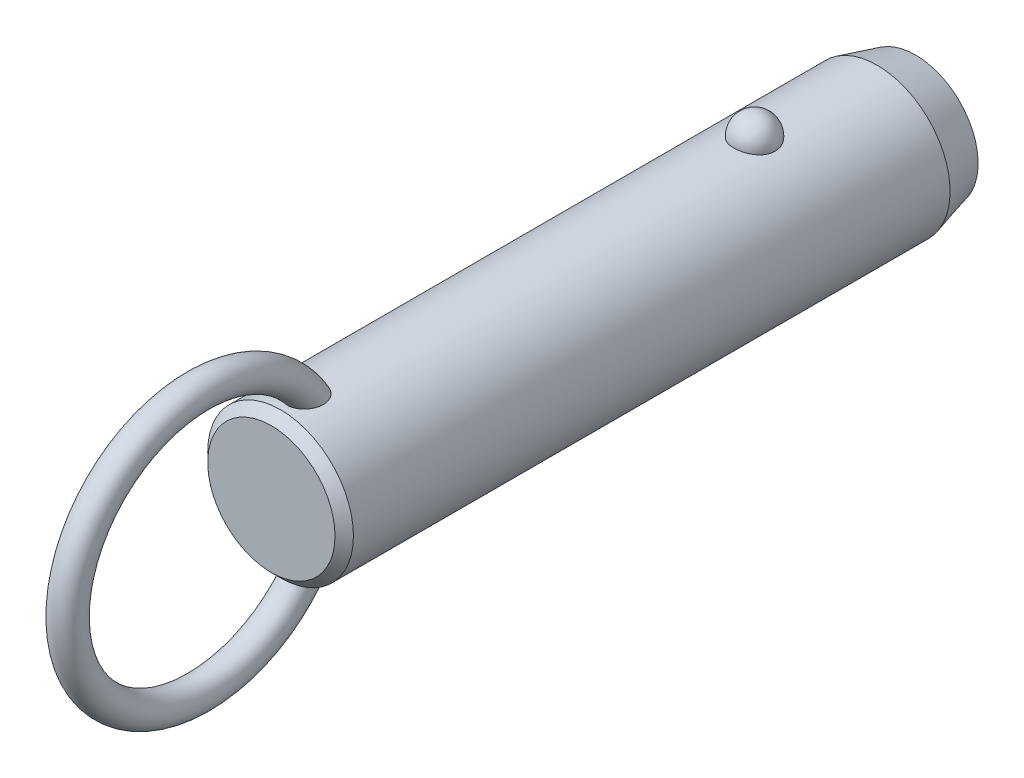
ISO-10303-21;
HEADER;
FILE_DESCRIPTION(('STEP AP214'),'2;1');
FILE_NAME('part.step','',(''),(''),'','','');
FILE_SCHEMA(('AUTOMOTIVE_DESIGN { 1 0 10303 214 1 1 1 1 }'));
ENDSEC;
DATA;
#1=APPLICATION_CONTEXT('core data for automotive mechanical design processes');
#2=APPLICATION_PROTOCOL_DEFINITION('international standard','automotive_design',2000,#1);
#3=PRODUCT_CONTEXT('',#1,'mechanical');
#4=PRODUCT('Part','Part','',(#3));
#5=PRODUCT_RELATED_PRODUCT_CATEGORY('part','',(#4));
#6=PRODUCT_DEFINITION_FORMATION('','',#4);
#7=PRODUCT_DEFINITION_CONTEXT('part definition',#1,'design');
#8=PRODUCT_DEFINITION('design','',#6,#7);
#9=PRODUCT_DEFINITION_SHAPE('','',#8);
#10=(LENGTH_UNIT() NAMED_UNIT(*) SI_UNIT(.MILLI.,.METRE.));
#11=(NAMED_UNIT(*) PLANE_ANGLE_UNIT() SI_UNIT($,.RADIAN.));
#12=(NAMED_UNIT(*) SI_UNIT($,.STERADIAN.) SOLID_ANGLE_UNIT());
#13=UNCERTAINTY_MEASURE_WITH_UNIT(LENGTH_MEASURE(1.E-05),#10,'distance_accuracy_value','');
#14=(GEOMETRIC_REPRESENTATION_CONTEXT(3) GLOBAL_UNCERTAINTY_ASSIGNED_CONTEXT((#13)) GLOBAL_UNIT_ASSIGNED_CONTEXT((#10,
#11,#12)) REPRESENTATION_CONTEXT('',''));
#15=CARTESIAN_POINT('',(0.,0.,0.));
#16=DIRECTION('',(0.,0.,1.));
#17=DIRECTION('',(1.,0.,0.));
#18=AXIS2_PLACEMENT_3D('',#15,#16,#17);
#19=CARTESIAN_POINT('',(0.,0.,50.8));
#20=DIRECTION('',(0.,0.,-1.));
#21=DIRECTION('',(-1.,0.,0.));
#22=AXIS2_PLACEMENT_3D('',#19,#20,#21);
#23=CYLINDRICAL_SURFACE('',#22,9.5);
#24=CARTESIAN_POINT('',(2.67259918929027,9.11631578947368,-2.7));
#25=CARTESIAN_POINT('',(2.6725968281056,9.11631786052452,-2.54909854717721));
#26=CARTESIAN_POINT('',(2.66030567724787,9.11994722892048,-2.39816735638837));
#27=CARTESIAN_POINT('',(2.6114347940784,9.13405924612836,-2.10058568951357));
#28=CARTESIAN_POINT('',(2.57484658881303,9.14454428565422,-1.95393672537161));
#29=CARTESIAN_POINT('',(2.47830875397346,9.17117631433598,-1.66916069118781));
#30=CARTESIAN_POINT('',(2.41836936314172,9.18732082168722,-1.53102991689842));
#31=CARTESIAN_POINT('',(2.27661331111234,9.22346780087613,-1.26705393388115));
#32=CARTESIAN_POINT('',(2.19479699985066,9.24347021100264,-1.14120852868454));
#33=CARTESIAN_POINT('',(2.01085282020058,9.28522401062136,-0.904632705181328));
#34=CARTESIAN_POINT('',(1.90862396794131,9.30698376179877,-0.793982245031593));
#35=CARTESIAN_POINT('',(1.6867437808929,9.34973971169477,-0.591607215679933));
#36=CARTESIAN_POINT('',(1.56709244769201,9.37073591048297,-0.49988264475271));
#37=CARTESIAN_POINT('',(1.31393976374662,9.40956370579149,-0.338167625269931));
#38=CARTESIAN_POINT('',(1.18048026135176,9.42740444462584,-0.268113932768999));
#39=CARTESIAN_POINT('',(0.903154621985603,9.45799906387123,-0.151390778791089));
#40=CARTESIAN_POINT('',(0.759289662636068,9.47075351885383,-0.104718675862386));
#41=CARTESIAN_POINT('',(0.468074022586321,9.48956256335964,-0.0367633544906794));
#42=CARTESIAN_POINT('',(0.320836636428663,9.49573643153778,-0.0150275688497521));
#43=CARTESIAN_POINT('',(0.0246714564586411,9.50112183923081,0.00396199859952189));
#44=CARTESIAN_POINT('',(-0.124256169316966,9.50033406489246,0.00121819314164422));
#45=CARTESIAN_POINT('',(-0.417264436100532,9.4919475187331,-0.02844418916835));
#46=CARTESIAN_POINT('',(-0.56138413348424,9.48444885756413,-0.0550074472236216));
#47=CARTESIAN_POINT('',(-0.842986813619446,9.46357853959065,-0.13106494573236));
#48=CARTESIAN_POINT('',(-0.980469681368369,9.450206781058,-0.180559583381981));
#49=CARTESIAN_POINT('',(-1.24585005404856,9.41890822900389,-0.301476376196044));
#50=CARTESIAN_POINT('',(-1.37368611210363,9.40095498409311,-0.373026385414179));
#51=CARTESIAN_POINT('',(-1.61552738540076,9.36242964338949,-0.536025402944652));
#52=CARTESIAN_POINT('',(-1.72953116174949,9.34185727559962,-0.627476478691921));
#53=CARTESIAN_POINT('',(-1.9429225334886,9.29984568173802,-0.829844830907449));
#54=CARTESIAN_POINT('',(-2.04198021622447,9.27839736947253,-0.941108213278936));
#55=CARTESIAN_POINT('',(-2.22026460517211,9.23735994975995,-1.17883414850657));
#56=CARTESIAN_POINT('',(-2.29948985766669,9.21777097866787,-1.30529781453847));
#57=CARTESIAN_POINT('',(-2.43697287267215,9.18238994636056,-1.57158566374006));
#58=CARTESIAN_POINT('',(-2.49497068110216,9.16664569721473,-1.71155057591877));
#59=CARTESIAN_POINT('',(-2.5872073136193,9.14104303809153,-1.99961197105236));
#60=CARTESIAN_POINT('',(-2.62144683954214,9.13118445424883,-2.14770821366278));
#61=CARTESIAN_POINT('',(-2.66521466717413,9.11850622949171,-2.44715424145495));
#62=CARTESIAN_POINT('',(-2.67484831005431,9.11565658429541,-2.59848735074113));
#63=CARTESIAN_POINT('',(-2.66946735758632,9.11723375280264,-2.90067317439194));
#64=CARTESIAN_POINT('',(-2.65445345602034,9.12166036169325,-3.05152590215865));
#65=CARTESIAN_POINT('',(-2.60029711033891,9.13724422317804,-3.34766110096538));
#66=CARTESIAN_POINT('',(-2.56127978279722,9.14836656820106,-3.49296833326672));
#67=CARTESIAN_POINT('',(-2.46018844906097,9.17606676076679,-3.77477535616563));
#68=CARTESIAN_POINT('',(-2.39811349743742,9.1926448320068,-3.9112747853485));
#69=CARTESIAN_POINT('',(-2.25202303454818,9.22952198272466,-4.17244273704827));
#70=CARTESIAN_POINT('',(-2.16788714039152,9.24984129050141,-4.29704106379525));
#71=CARTESIAN_POINT('',(-1.9799408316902,9.29188255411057,-4.53013066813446));
#72=CARTESIAN_POINT('',(-1.87612963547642,9.31360456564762,-4.63862130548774));
#73=CARTESIAN_POINT('',(-1.65105429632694,9.35612959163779,-4.8369029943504));
#74=CARTESIAN_POINT('',(-1.52972405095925,9.37692871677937,-4.92661991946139));
#75=CARTESIAN_POINT('',(-1.27318250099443,9.41518970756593,-5.08429106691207));
#76=CARTESIAN_POINT('',(-1.13797219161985,9.432651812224,-5.15224684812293));
#77=CARTESIAN_POINT('',(-0.859280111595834,9.46208255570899,-5.26371827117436));
#78=CARTESIAN_POINT('',(-0.715925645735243,9.47411833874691,-5.30753421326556));
#79=CARTESIAN_POINT('',(-0.423550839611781,9.4916822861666,-5.37076321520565));
#80=CARTESIAN_POINT('',(-0.2745312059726,9.49721125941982,-5.39017930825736));
#81=CARTESIAN_POINT('',(0.0218446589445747,9.50110860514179,-5.40390587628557));
#82=CARTESIAN_POINT('',(0.16917707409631,9.49961381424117,-5.39869609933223));
#83=CARTESIAN_POINT('',(0.460808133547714,9.48993906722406,-5.36441955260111));
#84=CARTESIAN_POINT('',(0.605106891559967,9.48175936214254,-5.33535367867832));
#85=CARTESIAN_POINT('',(0.886027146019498,9.4596376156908,-5.25435587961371));
#86=CARTESIAN_POINT('',(1.02267710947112,9.44571881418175,-5.20251612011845));
#87=CARTESIAN_POINT('',(1.28523827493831,9.41358993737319,-5.07741549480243));
#88=CARTESIAN_POINT('',(1.41114877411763,9.39537958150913,-5.00415322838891));
#89=CARTESIAN_POINT('',(1.65085227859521,9.3562644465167,-4.83684599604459));
#90=CARTESIAN_POINT('',(1.76442346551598,9.33532178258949,-4.74249218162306));
#91=CARTESIAN_POINT('',(1.97425672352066,9.29321198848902,-4.53620389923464));
#92=CARTESIAN_POINT('',(2.07051582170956,9.27204482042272,-4.42426641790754));
#93=CARTESIAN_POINT('',(2.24490086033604,9.23139221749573,-4.18363183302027));
#94=CARTESIAN_POINT('',(2.32267019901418,9.21194380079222,-4.05466990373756));
#95=CARTESIAN_POINT('',(2.45584092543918,9.1773419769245,-3.78517836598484));
#96=CARTESIAN_POINT('',(2.5112497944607,9.16218713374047,-3.64465264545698));
#97=CARTESIAN_POINT('',(2.59380876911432,9.13913522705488,-3.37104301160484));
#98=CARTESIAN_POINT('',(2.62330266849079,9.13064624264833,-3.23871053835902));
#99=CARTESIAN_POINT('',(2.66269870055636,9.11923566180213,-2.97092664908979));
#100=CARTESIAN_POINT('',(2.67260130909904,9.11631393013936,-2.8354753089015));
#101=CARTESIAN_POINT('',(2.67259918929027,9.11631578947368,-2.7));
#102=B_SPLINE_CURVE_WITH_KNOTS('',3,(#24,#25,#26,#27,#28,#29,#30,#31,#32,#33,#34,#35,#36,#37,
#38,#39,#40,#41,#42,#43,#44,#45,#46,#47,#48,#49,#50,#51,#52,#53,#54,#55,#56,#57,#58,#59,#60,#61,
#62,#63,#64,#65,#66,#67,#68,#69,#70,#71,#72,#73,#74,#75,#76,#77,#78,#79,#80,#81,#82,#83,#84,#85,
#86,#87,#88,#89,#90,#91,#92,#93,#94,#95,#96,#97,#98,#99,#100,#101),.UNSPECIFIED.,.T.,.F.,(4,2,2,
2,2,2,2,2,2,2,2,2,2,2,2,2,2,2,2,2,2,2,2,2,2,2,2,2,2,2,2,2,2,2,2,2,2,2,4),(0.,0.452217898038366,
0.904593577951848,1.35677112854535,1.80894144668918,2.26340676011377,2.71787203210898,
3.17099820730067,3.62407318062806,4.0687883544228,4.51345969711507,4.95160616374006,
5.38976021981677,5.83050358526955,6.27129275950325,6.72071308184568,7.17016633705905,
7.62495278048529,8.07972578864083,8.53254856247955,8.98535859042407,9.43582813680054,
9.88631615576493,10.3393155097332,10.7923328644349,11.2471065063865,11.7018475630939,
12.150795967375,12.599688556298,13.0398725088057,13.4800399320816,13.9184421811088,
14.3568730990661,14.802202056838,15.2476074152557,15.7010097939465,16.1542603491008,
16.5602594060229,16.966248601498),.UNSPECIFIED.);
#103=CARTESIAN_POINT('',(2.67259918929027,9.11631578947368,-2.7));
#104=VERTEX_POINT('',#103);
#105=EDGE_CURVE('E41',#104,#104,#102,.T.);
#106=ORIENTED_EDGE('',*,*,#105,.T.);
#107=EDGE_LOOP('',(#106));
#108=FACE_BOUND('',#107,.T.);
#109=CARTESIAN_POINT('',(0.,0.,59.12));
#110=DIRECTION('',(0.,0.,1.));
#111=DIRECTION('',(1.,0.,0.));
#112=AXIS2_PLACEMENT_3D('',#109,#110,#111);
#113=CIRCLE('',#112,9.5);
#114=CARTESIAN_POINT('',(9.5,0.,59.12));
#115=VERTEX_POINT('',#114);
#116=EDGE_CURVE('E10',#115,#115,#113,.F.);
#117=ORIENTED_EDGE('',*,*,#116,.T.);
#118=EDGE_LOOP('',(#117));
#119=FACE_BOUND('',#118,.T.);
#120=CARTESIAN_POINT('',(-0.697062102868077,-9.47439269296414,53.4678088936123));
#121=CARTESIAN_POINT('',(-0.799579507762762,-9.46685146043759,53.5074823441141));
#122=CARTESIAN_POINT('',(-0.898575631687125,-9.45788043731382,53.5559309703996));
#123=CARTESIAN_POINT('',(-1.08670047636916,-9.43811593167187,53.6688685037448));
#124=CARTESIAN_POINT('',(-1.17583204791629,-9.42732297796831,53.7333527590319));
#125=CARTESIAN_POINT('',(-1.34179806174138,-9.40513672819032,53.8762099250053));
#126=CARTESIAN_POINT('',(-1.41865133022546,-9.39374438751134,53.954561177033));
#127=CARTESIAN_POINT('',(-1.5586004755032,-9.37154196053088,54.1227524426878));
#128=CARTESIAN_POINT('',(-1.62169476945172,-9.3607319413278,54.2125937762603));
#129=CARTESIAN_POINT('',(-1.73527695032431,-9.34035749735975,54.4045001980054));
#130=CARTESIAN_POINT('',(-1.7852226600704,-9.33085270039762,54.5068910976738));
#131=CARTESIAN_POINT('',(-1.86924997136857,-9.3143834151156,54.718148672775));
#132=CARTESIAN_POINT('',(-1.90332570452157,-9.30741986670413,54.8270177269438));
#133=CARTESIAN_POINT('',(-1.95893603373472,-9.29588482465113,55.0604730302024));
#134=CARTESIAN_POINT('',(-1.97872420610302,-9.29165182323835,55.1854890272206));
#135=CARTESIAN_POINT('',(-2.00062129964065,-9.28695978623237,55.4370805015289));
#136=CARTESIAN_POINT('',(-2.00272284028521,-9.28650232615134,55.563656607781));
#137=CARTESIAN_POINT('',(-1.98958876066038,-9.28932750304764,55.8368157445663));
#138=CARTESIAN_POINT('',(-1.97143366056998,-9.2932400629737,55.9832519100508));
#139=CARTESIAN_POINT('',(-1.91479925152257,-9.30507151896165,56.2720629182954));
#140=CARTESIAN_POINT('',(-1.87629122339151,-9.31299607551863,56.414431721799));
#141=CARTESIAN_POINT('',(-1.77225683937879,-9.33340232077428,56.7151725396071));
#142=CARTESIAN_POINT('',(-1.70334898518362,-9.34641636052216,56.8723691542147));
#143=CARTESIAN_POINT('',(-1.58111062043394,-9.36759153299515,57.0975171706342));
#144=CARTESIAN_POINT('',(-1.53721459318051,-9.37492619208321,57.1707968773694));
#145=CARTESIAN_POINT('',(-1.44302631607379,-9.38988566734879,57.3130740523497));
#146=CARTESIAN_POINT('',(-1.39273721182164,-9.39751033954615,57.3820736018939));
#147=CARTESIAN_POINT('',(-1.26775962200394,-9.41530678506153,57.5369832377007));
#148=CARTESIAN_POINT('',(-1.19052326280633,-9.42548108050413,57.6208712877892));
#149=CARTESIAN_POINT('',(-1.02420241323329,-9.44499825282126,57.7760086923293));
#150=CARTESIAN_POINT('',(-0.935139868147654,-9.45434261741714,57.8472808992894));
#151=CARTESIAN_POINT('',(-0.766610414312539,-9.46930670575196,57.9586955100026));
#152=CARTESIAN_POINT('',(-0.689439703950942,-9.47529223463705,58.0022354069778));
#153=CARTESIAN_POINT('',(-0.528942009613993,-9.48560294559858,58.0763133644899));
#154=CARTESIAN_POINT('',(-0.44562029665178,-9.48992953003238,58.1068624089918));
#155=CARTESIAN_POINT('',(-0.273901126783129,-9.49644161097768,58.1525792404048));
#156=CARTESIAN_POINT('',(-0.185465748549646,-9.49860811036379,58.16761059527));
#157=CARTESIAN_POINT('',(-0.00734541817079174,-9.5004135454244,58.1801494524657));
#158=CARTESIAN_POINT('',(0.0823387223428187,-9.50005405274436,58.1776678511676));
#159=CARTESIAN_POINT('',(0.247679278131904,-9.49708301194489,58.1569959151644));
#160=CARTESIAN_POINT('',(0.323620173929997,-9.49477609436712,58.1409300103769));
#161=CARTESIAN_POINT('',(0.471981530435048,-9.48855917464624,58.0971726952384));
#162=CARTESIAN_POINT('',(0.54440029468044,-9.48464840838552,58.0694757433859));
#163=CARTESIAN_POINT('',(0.708947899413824,-9.47398336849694,57.9928026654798));
#164=CARTESIAN_POINT('',(0.799149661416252,-9.46671310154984,57.9397745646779));
#165=CARTESIAN_POINT('',(0.969783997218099,-9.4507622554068,57.8199731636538));
#166=CARTESIAN_POINT('',(1.05019415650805,-9.44207854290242,57.7531692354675));
#167=CARTESIAN_POINT('',(1.23092343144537,-9.42051459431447,57.5807596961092));
#168=CARTESIAN_POINT('',(1.32652499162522,-9.40733378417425,57.4702619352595));
#169=CARTESIAN_POINT('',(1.49893121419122,-9.38140745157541,57.2355614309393));
#170=CARTESIAN_POINT('',(1.57571616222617,-9.36866239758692,57.1113445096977));
#171=CARTESIAN_POINT('',(1.71285426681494,-9.34457644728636,56.8493891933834));
#172=CARTESIAN_POINT('',(1.77266365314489,-9.33328726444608,56.7113623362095));
#173=CARTESIAN_POINT('',(1.87239208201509,-9.31379209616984,56.4280515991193));
#174=CARTESIAN_POINT('',(1.91230158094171,-9.3055875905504,56.282764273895));
#175=CARTESIAN_POINT('',(1.9760418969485,-9.29228394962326,55.9620281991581));
#176=CARTESIAN_POINT('',(1.99587438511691,-9.28797202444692,55.7857248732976));
#177=CARTESIAN_POINT('',(2.0029570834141,-9.28645519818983,55.4324146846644));
#178=CARTESIAN_POINT('',(1.99025930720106,-9.28923895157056,55.2554093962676));
#179=CARTESIAN_POINT('',(1.93735479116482,-9.30038134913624,54.9563381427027));
#180=CARTESIAN_POINT('',(1.90576827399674,-9.30697680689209,54.8326679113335));
#181=CARTESIAN_POINT('',(1.82287484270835,-9.32356855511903,54.5923297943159));
#182=CARTESIAN_POINT('',(1.77158213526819,-9.33356239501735,54.4756569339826));
#183=CARTESIAN_POINT('',(1.64885744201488,-9.35602275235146,54.2527061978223));
#184=CARTESIAN_POINT('',(1.57730995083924,-9.36850332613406,54.1464927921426));
#185=CARTESIAN_POINT('',(1.41543264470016,-9.39431873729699,53.9495530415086));
#186=CARTESIAN_POINT('',(1.32510883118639,-9.40765330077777,53.8588217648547));
#187=CARTESIAN_POINT('',(1.13846223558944,-9.43195720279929,53.7050334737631));
#188=CARTESIAN_POINT('',(1.04369890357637,-9.44302894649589,53.6400947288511));
#189=CARTESIAN_POINT('',(0.843965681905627,-9.46296805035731,53.5280388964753));
#190=CARTESIAN_POINT('',(0.739000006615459,-9.4718363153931,53.4809144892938));
#191=CARTESIAN_POINT('',(0.528175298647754,-9.48586140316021,53.4081173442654));
#192=CARTESIAN_POINT('',(0.422686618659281,-9.49119633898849,53.3814024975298));
#193=CARTESIAN_POINT('',(0.208590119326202,-9.49831365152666,53.3460137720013));
#194=CARTESIAN_POINT('',(0.0999817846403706,-9.500095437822,53.3373428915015));
#195=CARTESIAN_POINT('',(-0.126104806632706,-9.49988861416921,53.3383501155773));
#196=CARTESIAN_POINT('',(-0.243578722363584,-9.49757821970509,53.3495942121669));
#197=CARTESIAN_POINT('',(-0.474390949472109,-9.48885165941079,53.393167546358));
#198=CARTESIAN_POINT('',(-0.587729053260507,-9.48243528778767,53.4254978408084));
#199=CARTESIAN_POINT('',(-0.697062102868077,-9.47439269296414,53.4678088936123));
#200=B_SPLINE_CURVE_WITH_KNOTS('',3,(#120,#121,#122,#123,#124,#125,#126,#127,#128,#129,#130,
#131,#132,#133,#134,#135,#136,#137,#138,#139,#140,#141,#142,#143,#144,#145,#146,#147,#148,#149,
#150,#151,#152,#153,#154,#155,#156,#157,#158,#159,#160,#161,#162,#163,#164,#165,#166,#167,#168,
#169,#170,#171,#172,#173,#174,#175,#176,#177,#178,#179,#180,#181,#182,#183,#184,#185,#186,#187,
#188,#189,#190,#191,#192,#193,#194,#195,#196,#197,#198,#199),.UNSPECIFIED.,.T.,.F.,(4,2,2,2,2,2,
2,2,2,2,2,2,2,2,2,2,2,2,2,2,2,2,2,2,2,2,2,2,2,2,2,2,2,2,2,2,2,2,2,4),(0.,0.330119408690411,
0.660143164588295,0.989655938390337,1.31920659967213,1.66074728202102,2.00241415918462,
2.38088696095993,2.75951768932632,3.20065679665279,3.6424200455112,4.15620996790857,
4.41314162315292,4.66994734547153,5.01228664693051,5.35399933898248,5.61943037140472,
5.88463652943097,6.15215502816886,6.41950709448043,6.65144391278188,6.88349136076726,
7.19641200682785,7.51003602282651,7.94779711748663,8.38601491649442,8.83699707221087,
9.28819530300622,9.81778662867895,10.3465317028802,10.7284172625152,11.1100280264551,
11.4938603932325,11.8775702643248,12.2220189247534,12.5663259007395,12.8915939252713,
13.2169159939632,13.5689650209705,13.9210316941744),.UNSPECIFIED.);
#201=CARTESIAN_POINT('',(-0.697062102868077,-9.47439269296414,53.4678088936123));
#202=VERTEX_POINT('',#201);
#203=EDGE_CURVE('E60',#202,#202,#200,.T.);
#204=ORIENTED_EDGE('',*,*,#203,.T.);
#205=EDGE_LOOP('',(#204));
#206=FACE_BOUND('',#205,.T.);
#207=CARTESIAN_POINT('',(-0.697062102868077,9.47439269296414,53.4678088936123));
#208=CARTESIAN_POINT('',(-0.597792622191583,9.48169483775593,53.4293956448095));
#209=CARTESIAN_POINT('',(-0.495106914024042,9.48766580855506,53.3991682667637));
#210=CARTESIAN_POINT('',(-0.285876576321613,9.49627648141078,53.3560327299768));
#211=CARTESIAN_POINT('',(-0.179324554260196,9.49890941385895,53.3431597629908));
#212=CARTESIAN_POINT('',(0.0344157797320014,9.50053798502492,53.3351666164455));
#213=CARTESIAN_POINT('',(0.141603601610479,9.49953613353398,53.3400341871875));
#214=CARTESIAN_POINT('',(0.353563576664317,9.49401038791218,53.3673654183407));
#215=CARTESIAN_POINT('',(0.458336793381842,9.48948807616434,53.38982117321));
#216=CARTESIAN_POINT('',(0.66249373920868,9.4774236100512,53.4516719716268));
#217=CARTESIAN_POINT('',(0.761881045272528,9.46988348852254,53.4910556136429));
#218=CARTESIAN_POINT('',(0.952608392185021,9.45260382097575,53.5856342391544));
#219=CARTESIAN_POINT('',(1.04394806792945,9.44286417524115,53.6408299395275));
#220=CARTESIAN_POINT('',(1.21712767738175,9.4221176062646,53.7660662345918));
#221=CARTESIAN_POINT('',(1.29885671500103,9.41109835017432,53.8362579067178));
#222=CARTESIAN_POINT('',(1.4497897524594,9.38903310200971,53.988980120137));
#223=CARTESIAN_POINT('',(1.51899278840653,9.37798710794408,54.0715116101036));
#224=CARTESIAN_POINT('',(1.64602857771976,9.35654375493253,54.2497763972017));
#225=CARTESIAN_POINT('',(1.70333052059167,9.34618688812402,54.3458916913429));
#226=CARTESIAN_POINT('',(1.80259341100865,9.32755128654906,54.545897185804));
#227=CARTESIAN_POINT('',(1.84454942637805,9.31927322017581,54.6497898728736));
#228=CARTESIAN_POINT('',(1.91637039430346,9.30478365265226,54.8722131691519));
#229=CARTESIAN_POINT('',(1.944805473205,9.29882552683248,54.9912192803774));
#230=CARTESIAN_POINT('',(1.98449865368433,9.29043398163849,55.2321436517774));
#231=CARTESIAN_POINT('',(1.99574908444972,9.28800213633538,55.3540631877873));
#232=CARTESIAN_POINT('',(2.00275141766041,9.28649645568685,55.6169324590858));
#233=CARTESIAN_POINT('',(1.99588238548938,9.28799035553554,55.7579529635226));
#234=CARTESIAN_POINT('',(1.96270559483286,9.29505517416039,56.0376217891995));
#235=CARTESIAN_POINT('',(1.93637872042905,9.30063010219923,56.176267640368));
#236=CARTESIAN_POINT('',(1.85949176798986,9.31633564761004,56.4725616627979));
#237=CARTESIAN_POINT('',(1.80549792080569,9.3270926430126,56.6292907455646));
#238=CARTESIAN_POINT('',(1.67376869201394,9.3516306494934,56.9322840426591));
#239=CARTESIAN_POINT('',(1.59603181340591,9.36541185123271,57.0785475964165));
#240=CARTESIAN_POINT('',(1.4360277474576,9.39110706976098,57.3258138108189));
#241=CARTESIAN_POINT('',(1.35831795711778,9.40278656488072,57.429791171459));
#242=CARTESIAN_POINT('',(1.18774483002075,9.42585025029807,57.6245347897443));
#243=CARTESIAN_POINT('',(1.09490932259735,9.43723493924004,57.7153247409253));
#244=CARTESIAN_POINT('',(0.921110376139,9.45552616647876,57.8562033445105));
#245=CARTESIAN_POINT('',(0.843738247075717,9.46281058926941,57.9106563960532));
#246=CARTESIAN_POINT('',(0.681245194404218,9.47589120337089,58.0067117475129));
#247=CARTESIAN_POINT('',(0.596135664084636,9.48168953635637,58.0483325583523));
#248=CARTESIAN_POINT('',(0.433779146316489,9.49038144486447,58.1100899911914));
#249=CARTESIAN_POINT('',(0.357459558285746,9.49359170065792,58.1326013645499));
#250=CARTESIAN_POINT('',(0.20207411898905,9.49816761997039,58.1645745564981));
#251=CARTESIAN_POINT('',(0.12301025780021,9.49953459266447,58.1740456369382));
#252=CARTESIAN_POINT('',(-0.0357372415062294,9.50026497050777,58.1791143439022));
#253=CARTESIAN_POINT('',(-0.115421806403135,9.49962433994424,58.1746840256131));
#254=CARTESIAN_POINT('',(-0.272823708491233,9.49640854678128,58.1522962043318));
#255=CARTESIAN_POINT('',(-0.350540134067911,9.4938325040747,58.1343325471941));
#256=CARTESIAN_POINT('',(-0.500580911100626,9.4870946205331,58.0868028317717));
#257=CARTESIAN_POINT('',(-0.572979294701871,9.48296359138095,58.0574618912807));
#258=CARTESIAN_POINT('',(-0.712864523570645,9.47347609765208,57.9890087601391));
#259=CARTESIAN_POINT('',(-0.7803490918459,9.46811906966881,57.9498920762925));
#260=CARTESIAN_POINT('',(-0.946309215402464,9.45329720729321,57.839432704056));
#261=CARTESIAN_POINT('',(-1.04090230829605,9.44321512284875,57.7623297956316));
#262=CARTESIAN_POINT('',(-1.21661929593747,9.42219227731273,57.5940971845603));
#263=CARTESIAN_POINT('',(-1.29770519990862,9.41124921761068,57.5029292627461));
#264=CARTESIAN_POINT('',(-1.4731964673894,9.38563439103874,57.2761621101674));
#265=CARTESIAN_POINT('',(-1.56208878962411,9.37102009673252,57.1362895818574));
#266=CARTESIAN_POINT('',(-1.71623987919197,9.34401559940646,56.8439503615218));
#267=CARTESIAN_POINT('',(-1.7814786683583,9.33162728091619,56.6914731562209));
#268=CARTESIAN_POINT('',(-1.88853837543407,9.31055541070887,56.3756470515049));
#269=CARTESIAN_POINT('',(-1.9299899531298,9.30193076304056,56.2121685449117));
#270=CARTESIAN_POINT('',(-1.98590726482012,9.29015757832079,55.8805268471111));
#271=CARTESIAN_POINT('',(-2.00040705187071,9.2870021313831,55.7123698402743));
#272=CARTESIAN_POINT('',(-1.99964701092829,9.28716218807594,55.4050806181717));
#273=CARTESIAN_POINT('',(-1.98908145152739,9.28945704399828,55.2659362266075));
#274=CARTESIAN_POINT('',(-1.94566294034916,9.29865169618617,54.9911539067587));
#275=CARTESIAN_POINT('',(-1.91282062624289,9.30554929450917,54.855514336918));
#276=CARTESIAN_POINT('',(-1.84582133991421,9.31898248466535,54.6578026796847));
#277=CARTESIAN_POINT('',(-1.82038084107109,9.32400364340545,54.5925830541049));
#278=CARTESIAN_POINT('',(-1.76350511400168,9.33492884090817,54.4649033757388));
#279=CARTESIAN_POINT('',(-1.73207305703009,9.3408324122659,54.4024418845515));
#280=CARTESIAN_POINT('',(-1.66324243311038,9.353333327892,54.2809407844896));
#281=CARTESIAN_POINT('',(-1.62584239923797,9.35993084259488,54.2219020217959));
#282=CARTESIAN_POINT('',(-1.545276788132,9.37356864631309,54.1079875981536));
#283=CARTESIAN_POINT('',(-1.50211241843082,9.38060884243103,54.0531110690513));
#284=CARTESIAN_POINT('',(-1.37681147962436,9.40004442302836,53.9099619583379));
#285=CARTESIAN_POINT('',(-1.28916358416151,9.41261047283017,53.8264295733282));
#286=CARTESIAN_POINT('',(-1.09996826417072,9.43658180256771,53.6772360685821));
#287=CARTESIAN_POINT('',(-0.998461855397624,9.44799034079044,53.6115238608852));
#288=CARTESIAN_POINT('',(-0.8601889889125,9.46103017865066,53.5394367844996));
#289=CARTESIAN_POINT('',(-0.828141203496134,9.46389141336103,53.5238511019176));
#290=CARTESIAN_POINT('',(-0.763210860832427,9.46934915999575,53.4944734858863));
#291=CARTESIAN_POINT('',(-0.73032830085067,9.47194567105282,53.4806815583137));
#292=CARTESIAN_POINT('',(-0.697062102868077,9.47439269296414,53.4678088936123));
#293=B_SPLINE_CURVE_WITH_KNOTS('',3,(#207,#208,#209,#210,#211,#212,#213,#214,#215,#216,#217,
#218,#219,#220,#221,#222,#223,#224,#225,#226,#227,#228,#229,#230,#231,#232,#233,#234,#235,#236,
#237,#238,#239,#240,#241,#242,#243,#244,#245,#246,#247,#248,#249,#250,#251,#252,#253,#254,#255,
#256,#257,#258,#259,#260,#261,#262,#263,#264,#265,#266,#267,#268,#269,#270,#271,#272,#273,#274,
#275,#276,#277,#278,#279,#280,#281,#282,#283,#284,#285,#286,#287,#288,#289,#290,#291,#292),
.UNSPECIFIED.,.T.,.F.,(4,2,2,2,2,2,2,2,2,2,2,2,2,2,2,2,2,2,2,2,2,2,2,2,2,2,2,2,2,2,2,2,2,2,2,2,
2,2,2,2,2,2,4),(0.,0.319942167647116,0.640532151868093,0.96090081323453,1.28112555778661,
1.60113495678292,1.92115886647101,2.24457323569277,2.56801248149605,2.90371927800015,
3.23953387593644,3.60560313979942,3.97183576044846,4.39383693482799,4.81625324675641,
5.31257045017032,5.80891895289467,6.19868344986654,6.58773876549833,6.87145417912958,
7.15475838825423,7.3926375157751,7.63034760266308,7.86853584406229,8.10683246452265,
8.3406366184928,8.57454843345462,8.93983939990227,9.30614105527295,9.80266668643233,
10.2996107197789,10.8040753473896,11.3079021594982,11.7249776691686,12.1418541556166,
12.3521485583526,12.562331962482,12.7725671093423,12.9827582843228,13.3458276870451,
13.7078449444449,13.8150604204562,13.9222762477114),.UNSPECIFIED.);
#294=CARTESIAN_POINT('',(-0.697062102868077,9.47439269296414,53.4678088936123));
#295=VERTEX_POINT('',#294);
#296=EDGE_CURVE('E68',#295,#295,#293,.T.);
#297=ORIENTED_EDGE('',*,*,#296,.T.);
#298=EDGE_LOOP('',(#297));
#299=FACE_BOUND('',#298,.T.);
#300=CARTESIAN_POINT('',(0.,0.,-18.6999999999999));
#301=DIRECTION('',(0.,0.,-1.));
#302=DIRECTION('',(-1.,0.,0.));
#303=AXIS2_PLACEMENT_3D('',#300,#301,#302);
#304=CIRCLE('',#303,9.5);
#305=CARTESIAN_POINT('',(-9.5,0.,-18.6999999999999));
#306=VERTEX_POINT('',#305);
#307=EDGE_CURVE('E57',#306,#306,#304,.F.);
#308=ORIENTED_EDGE('',*,*,#307,.T.);
#309=EDGE_LOOP('',(#308));
#310=FACE_BOUND('',#309,.T.);
#311=ADVANCED_FACE('F37',(#108,#119,#206,#299,#310),#23,.T.);
#312=CARTESIAN_POINT('',(0.,0.,-23.7));
#313=DIRECTION('',(0.,0.,-1.));
#314=DIRECTION('',(-1.,0.,0.));
#315=AXIS2_PLACEMENT_3D('',#312,#313,#314);
#316=PLANE('',#315);
#317=CARTESIAN_POINT('',(0.,0.,-23.7));
#318=DIRECTION('',(0.,0.,-1.));
#319=DIRECTION('',(-1.,0.,0.));
#320=AXIS2_PLACEMENT_3D('',#317,#318,#319);
#321=CIRCLE('',#320,8.16025403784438);
#322=CARTESIAN_POINT('',(-8.16025403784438,0.,-23.7));
#323=VERTEX_POINT('',#322);
#324=EDGE_CURVE('E67',#323,#323,#321,.T.);
#325=ORIENTED_EDGE('',*,*,#324,.T.);
#326=EDGE_LOOP('',(#325));
#327=FACE_BOUND('',#326,.T.);
#328=ADVANCED_FACE('F86',(#327),#316,.T.);
#329=CARTESIAN_POINT('',(0.,0.,-23.7));
#330=DIRECTION('',(0.,0.,1.));
#331=DIRECTION('',(1.,0.,0.));
#332=AXIS2_PLACEMENT_3D('',#329,#330,#331);
#333=CONICAL_SURFACE('',#332,8.16025403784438,0.261799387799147);
#334=ORIENTED_EDGE('',*,*,#307,.F.);
#335=EDGE_LOOP('',(#334));
#336=FACE_BOUND('',#335,.T.);
#337=ORIENTED_EDGE('',*,*,#324,.F.);
#338=EDGE_LOOP('',(#337));
#339=FACE_BOUND('',#338,.T.);
#340=ADVANCED_FACE('F84',(#336,#339),#333,.T.);
#341=CARTESIAN_POINT('',(0.,0.,60.32));
#342=DIRECTION('',(0.,0.,1.));
#343=DIRECTION('',(1.,0.,0.));
#344=AXIS2_PLACEMENT_3D('',#341,#342,#343);
#345=PLANE('',#344);
#346=CARTESIAN_POINT('',(0.,0.,60.32));
#347=DIRECTION('',(0.,0.,1.));
#348=DIRECTION('',(1.,0.,0.));
#349=AXIS2_PLACEMENT_3D('',#346,#347,#348);
#350=CIRCLE('',#349,8.30000000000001);
#351=CARTESIAN_POINT('',(8.30000000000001,0.,60.32));
#352=VERTEX_POINT('',#351);
#353=EDGE_CURVE('E50',#352,#352,#350,.T.);
#354=ORIENTED_EDGE('',*,*,#353,.T.);
#355=EDGE_LOOP('',(#354));
#356=FACE_BOUND('',#355,.T.);
#357=ADVANCED_FACE('F78',(#356),#345,.T.);
#358=CARTESIAN_POINT('',(0.,0.,69.85));
#359=DIRECTION('',(1.,0.,0.));
#360=DIRECTION('',(0.,0.,-1.));
#361=AXIS2_PLACEMENT_3D('',#358,#359,#360);
#362=TOROIDAL_SURFACE('',#361,17.05,2.);
#363=ORIENTED_EDGE('',*,*,#296,.F.);
#364=EDGE_LOOP('',(#363));
#365=FACE_BOUND('',#364,.T.);
#366=ORIENTED_EDGE('',*,*,#203,.F.);
#367=EDGE_LOOP('',(#366));
#368=FACE_BOUND('',#367,.T.);
#369=ADVANCED_FACE('F74',(#365,#368),#362,.T.);
#370=CARTESIAN_POINT('',(0.,0.,60.32));
#371=DIRECTION('',(0.,0.,-1.));
#372=DIRECTION('',(-1.,0.,0.));
#373=AXIS2_PLACEMENT_3D('',#370,#371,#372);
#374=CONICAL_SURFACE('',#373,8.30000000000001,0.785398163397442);
#375=ORIENTED_EDGE('',*,*,#116,.F.);
#376=EDGE_LOOP('',(#375));
#377=FACE_BOUND('',#376,.T.);
#378=ORIENTED_EDGE('',*,*,#353,.F.);
#379=EDGE_LOOP('',(#378));
#380=FACE_BOUND('',#379,.T.);
#381=ADVANCED_FACE('F39',(#377,#380),#374,.T.);
#382=CARTESIAN_POINT('',(0.,9.5,-2.7));
#383=DIRECTION('',(0.,1.,0.));
#384=DIRECTION('',(0.,0.,-1.));
#385=AXIS2_PLACEMENT_3D('',#382,#383,#384);
#386=SPHERICAL_SURFACE('',#385,2.7);
#387=ORIENTED_EDGE('',*,*,#105,.F.);
#388=EDGE_LOOP('',(#387));
#389=FACE_BOUND('',#388,.T.);
#390=ADVANCED_FACE('F80',(#389),#386,.T.);
#391=CLOSED_SHELL('',(#311,#328,#340,#357,#369,#381,#390));
#392=MANIFOLD_SOLID_BREP('B2',#391);
#393=ADVANCED_BREP_SHAPE_REPRESENTATION('',(#18,#392),#14);
#394=SHAPE_DEFINITION_REPRESENTATION(#9,#393);
ENDSEC;
END-ISO-10303-21;
